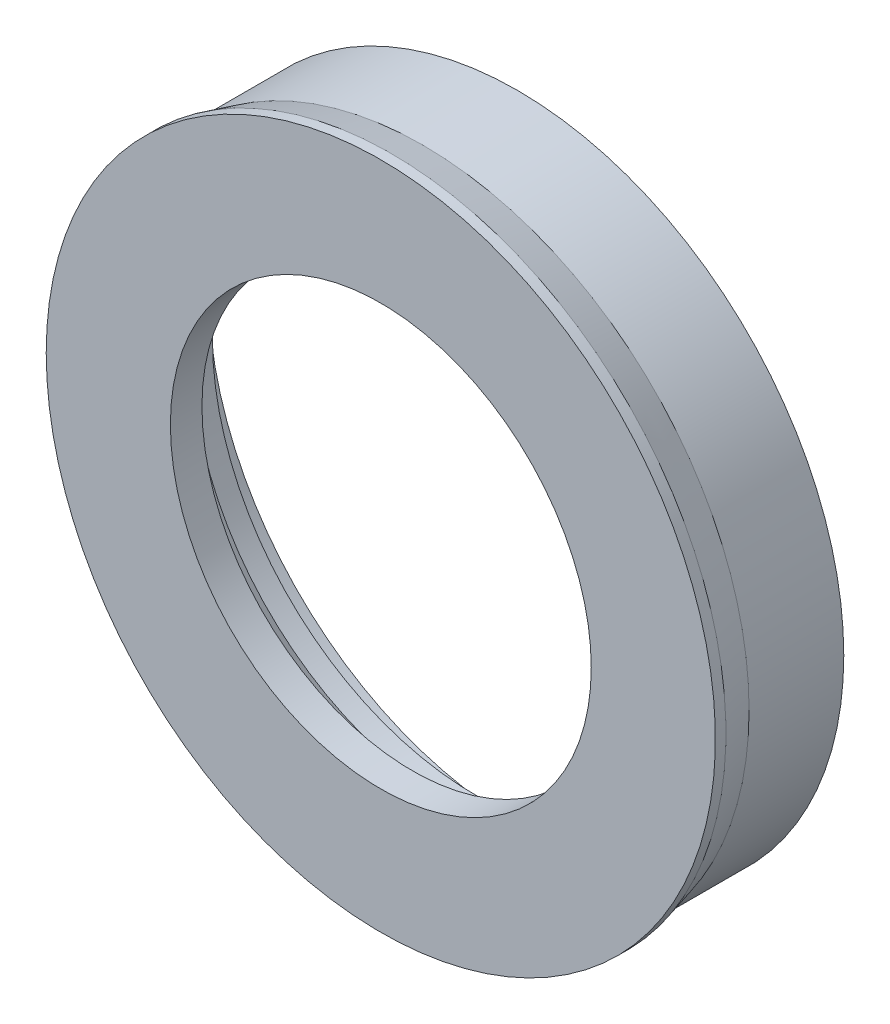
from build123d import *


with BuildPart() as part:
    # Esquisse1 → R_volution1 (revolve)
    with BuildSketch(Plane(origin=(0, 0, 0), x_dir=(0, 0, -1), z_dir=(1, 0, 0)), mode=Mode.PRIVATE) as r_volution1_sk:
        Polygon((-1.5, 15.9), (-1, 15.9), (0.5, 15.5), (5, 15.5), (5, 14.7), (3, 14.7), (3, 12.5), (2, 12.5), (1, 12), (1, 12.5), (0, 12.5), (0, 10), (-1.5, 10), align=None)
    revolve(r_volution1_sk.sketch.rotate(Axis((0, 0, 0), (0, 0, 1)), 90), axis=Axis((0, 0, 0), (0, 0, 1)))


solid = part.part
